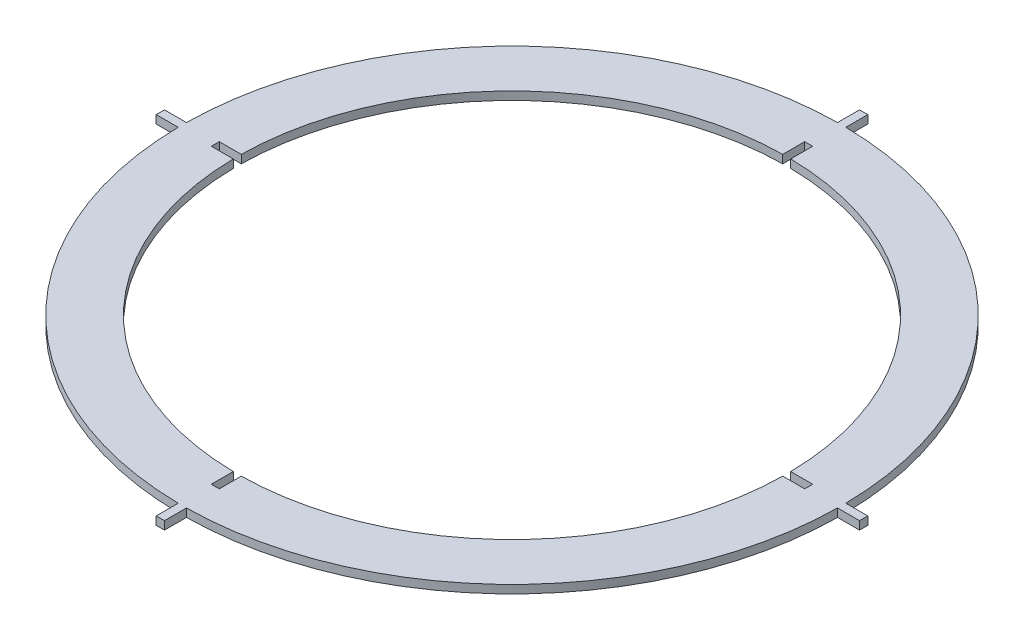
from build123d import *

# Parameters (mm, degrees)
BOSS_EXTRUDE1_DEPTH = 3


with BuildPart() as part:
    # Sketch1 → Boss-Extrude1 (new body)
    with BuildSketch(Plane(origin=(0, 0, 0), x_dir=(1, 0, 0), z_dir=(0, 1, 0))):
        with BuildLine():
            Line((127.990624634, 1.5), (119.990624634, 1.5))
            ThreePointArc((119.990624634, 1.5), (84.852813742, 84.852813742), (1.5, 119.990624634))
            Line((1.5, 119.990624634), (1.5, 127.990624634))
            Line((1.5, 127.990624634), (-1.5, 127.990624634))
            Line((-1.5, 127.990624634), (-1.5, 119.990624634))
            ThreePointArc((-1.5, 119.990624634), (-84.852813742, 84.852813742), (-119.990624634, 1.5))
            Line((-119.990624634, 1.5), (-127.990624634, 1.5))
            Line((-127.990624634, 1.5), (-127.990624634, -1.5))
            Line((-127.990624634, -1.5), (-119.990624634, -1.5))
            ThreePointArc((-119.990624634, -1.5), (-84.852813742, -84.852813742), (-1.5, -119.990624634))
            Line((-1.5, -119.990624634), (-1.5, -127.990624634))
            Line((-1.5, -127.990624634), (1.5, -127.990624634))
            Line((1.5, -127.990624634), (1.5, -119.990624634))
            ThreePointArc((1.5, -119.990624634), (84.852813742, -84.852813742), (119.990624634, -1.5))
            Line((119.990624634, -1.5), (127.990624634, -1.5))
            Line((127.990624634, -1.5), (127.990624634, 1.5))
        make_face()
        with BuildLine():
            ThreePointArc((99.989486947, 1.45), (70.710678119, 70.710678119), (1.45, 99.989486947))
            Line((1.45, 99.989486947), (1.45, 107.989486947))
            Line((1.45, 107.989486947), (-1.45, 107.989486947))
            Line((-1.45, 107.989486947), (-1.45, 99.989486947))
            ThreePointArc((-1.45, 99.989486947), (-70.710678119, 70.710678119), (-99.989486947, 1.45))
            Line((-99.989486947, 1.45), (-107.989486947, 1.45))
            Line((-107.989486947, 1.45), (-107.989486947, -1.45))
            Line((-107.989486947, -1.45), (-99.989486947, -1.45))
            ThreePointArc((-99.989486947, -1.45), (-70.710678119, -70.710678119), (-1.45, -99.989486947))
            Line((-1.45, -99.989486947), (-1.45, -107.989486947))
            Line((-1.45, -107.989486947), (1.45, -107.989486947))
            Line((1.45, -107.989486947), (1.45, -99.989486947))
            ThreePointArc((1.45, -99.989486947), (70.710678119, -70.710678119), (99.989486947, -1.45))
            Line((99.989486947, -1.45), (107.989486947, -1.45))
            Line((107.989486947, -1.45), (107.989486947, 1.45))
            Line((107.989486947, 1.45), (99.989486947, 1.45))
        make_face(mode=Mode.SUBTRACT)
    extrude(amount=BOSS_EXTRUDE1_DEPTH)


solid = part.part
